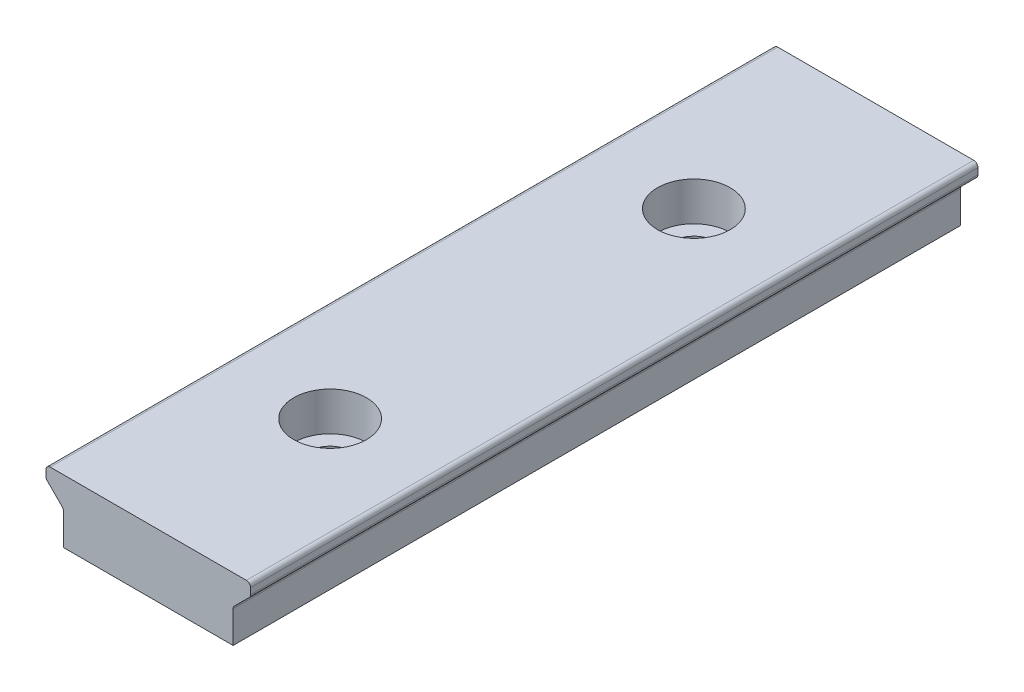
ISO-10303-21;
HEADER;
FILE_DESCRIPTION(('STEP AP214'),'2;1');
FILE_NAME('part.step','',(''),(''),'','','');
FILE_SCHEMA(('AUTOMOTIVE_DESIGN { 1 0 10303 214 1 1 1 1 }'));
ENDSEC;
DATA;
#1=APPLICATION_CONTEXT('core data for automotive mechanical design processes');
#2=APPLICATION_PROTOCOL_DEFINITION('international standard','automotive_design',2000,#1);
#3=PRODUCT_CONTEXT('',#1,'mechanical');
#4=PRODUCT('Part','Part','',(#3));
#5=PRODUCT_RELATED_PRODUCT_CATEGORY('part','',(#4));
#6=PRODUCT_DEFINITION_FORMATION('','',#4);
#7=PRODUCT_DEFINITION_CONTEXT('part definition',#1,'design');
#8=PRODUCT_DEFINITION('design','',#6,#7);
#9=PRODUCT_DEFINITION_SHAPE('','',#8);
#10=(LENGTH_UNIT() NAMED_UNIT(*) SI_UNIT(.MILLI.,.METRE.));
#11=(NAMED_UNIT(*) PLANE_ANGLE_UNIT() SI_UNIT($,.RADIAN.));
#12=(NAMED_UNIT(*) SI_UNIT($,.STERADIAN.) SOLID_ANGLE_UNIT());
#13=UNCERTAINTY_MEASURE_WITH_UNIT(LENGTH_MEASURE(1.E-05),#10,'distance_accuracy_value','');
#14=(GEOMETRIC_REPRESENTATION_CONTEXT(3) GLOBAL_UNCERTAINTY_ASSIGNED_CONTEXT((#13)) GLOBAL_UNIT_ASSIGNED_CONTEXT((#10,
#11,#12)) REPRESENTATION_CONTEXT('',''));
#15=CARTESIAN_POINT('',(0.,0.,0.));
#16=DIRECTION('',(0.,0.,1.));
#17=DIRECTION('',(1.,0.,0.));
#18=AXIS2_PLACEMENT_3D('',#15,#16,#17);
#19=CARTESIAN_POINT('',(0.,1.50487261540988E-13,60.0000000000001));
#20=DIRECTION('',(0.,1.,0.));
#21=DIRECTION('',(0.,0.,1.));
#22=AXIS2_PLACEMENT_3D('',#19,#20,#21);
#23=PLANE('',#22);
#24=CARTESIAN_POINT('',(0.,0.,45.0000000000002));
#25=DIRECTION('',(0.,1.,0.));
#26=DIRECTION('',(0.,0.,1.));
#27=AXIS2_PLACEMENT_3D('',#24,#25,#26);
#28=CIRCLE('',#27,1.75);
#29=CARTESIAN_POINT('',(0.,0.,46.7500000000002));
#30=VERTEX_POINT('',#29);
#31=EDGE_CURVE('E357',#30,#30,#28,.T.);
#32=ORIENTED_EDGE('',*,*,#31,.T.);
#33=EDGE_LOOP('',(#32));
#34=FACE_BOUND('',#33,.T.);
#35=CARTESIAN_POINT('',(0.,0.,15.0000000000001));
#36=DIRECTION('',(0.,1.,0.));
#37=DIRECTION('',(0.,0.,1.));
#38=AXIS2_PLACEMENT_3D('',#35,#36,#37);
#39=CIRCLE('',#38,1.75);
#40=CARTESIAN_POINT('',(0.,0.,16.7500000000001));
#41=VERTEX_POINT('',#40);
#42=EDGE_CURVE('E43',#41,#41,#39,.T.);
#43=ORIENTED_EDGE('',*,*,#42,.T.);
#44=EDGE_LOOP('',(#43));
#45=FACE_BOUND('',#44,.T.);
#46=DIRECTION('',(1.,0.,0.));
#47=VECTOR('',#46,1.);
#48=CARTESIAN_POINT('',(0.,0.,0.));
#49=LINE('',#48,#47);
#50=CARTESIAN_POINT('',(-6.99999999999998,0.,0.));
#51=VERTEX_POINT('',#50);
#52=CARTESIAN_POINT('',(6.99999999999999,0.,0.));
#53=VERTEX_POINT('',#52);
#54=EDGE_CURVE('E170',#51,#53,#49,.T.);
#55=ORIENTED_EDGE('',*,*,#54,.T.);
#56=DIRECTION('',(0.,0.,-1.));
#57=VECTOR('',#56,1.);
#58=CARTESIAN_POINT('',(7.00000000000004,1.21864324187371E-13,60.0000000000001));
#59=LINE('',#58,#57);
#60=CARTESIAN_POINT('',(7.00000000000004,1.21864324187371E-13,60.0000000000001));
#61=VERTEX_POINT('',#60);
#62=EDGE_CURVE('E244',#61,#53,#59,.T.);
#63=ORIENTED_EDGE('',*,*,#62,.F.);
#64=DIRECTION('',(1.,0.,0.));
#65=VECTOR('',#64,1.);
#66=CARTESIAN_POINT('',(0.,1.50487261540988E-13,60.0000000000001));
#67=LINE('',#66,#65);
#68=CARTESIAN_POINT('',(-6.9999999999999,1.46150452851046E-13,60.0000000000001));
#69=VERTEX_POINT('',#68);
#70=EDGE_CURVE('E185',#69,#61,#67,.T.);
#71=ORIENTED_EDGE('',*,*,#70,.F.);
#72=DIRECTION('',(0.,0.,-1.));
#73=VECTOR('',#72,1.);
#74=CARTESIAN_POINT('',(-6.9999999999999,1.46150452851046E-13,60.0000000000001));
#75=LINE('',#74,#73);
#76=EDGE_CURVE('E182',#69,#51,#75,.T.);
#77=ORIENTED_EDGE('',*,*,#76,.T.);
#78=EDGE_LOOP('',(#55,#63,#71,#77));
#79=FACE_BOUND('',#78,.T.);
#80=ADVANCED_FACE('F40',(#34,#45,#79),#23,.F.);
#81=CARTESIAN_POINT('',(7.00000000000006,2.7658328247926,60.0000000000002));
#82=DIRECTION('',(-1.,0.,0.));
#83=DIRECTION('',(0.,0.,1.));
#84=AXIS2_PLACEMENT_3D('',#81,#82,#83);
#85=PLANE('',#84);
#86=DIRECTION('',(0.,1.,0.));
#87=VECTOR('',#86,1.);
#88=CARTESIAN_POINT('',(7.,2.76583282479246,0.));
#89=LINE('',#88,#87);
#90=CARTESIAN_POINT('',(7.,2.6208580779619,0.));
#91=VERTEX_POINT('',#90);
#92=EDGE_CURVE('E177',#53,#91,#89,.T.);
#93=ORIENTED_EDGE('',*,*,#92,.T.);
#94=DIRECTION('',(0.,0.,-1.));
#95=VECTOR('',#94,1.);
#96=CARTESIAN_POINT('',(7.00000000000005,2.62085807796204,60.0000000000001));
#97=LINE('',#96,#95);
#98=CARTESIAN_POINT('',(7.00000000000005,2.62085807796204,60.0000000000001));
#99=VERTEX_POINT('',#98);
#100=EDGE_CURVE('E254',#91,#99,#97,.F.);
#101=ORIENTED_EDGE('',*,*,#100,.T.);
#102=DIRECTION('',(0.,1.,0.));
#103=VECTOR('',#102,1.);
#104=CARTESIAN_POINT('',(7.00000000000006,2.7658328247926,60.0000000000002));
#105=LINE('',#104,#103);
#106=EDGE_CURVE('E229',#61,#99,#105,.T.);
#107=ORIENTED_EDGE('',*,*,#106,.F.);
#108=ORIENTED_EDGE('',*,*,#62,.T.);
#109=EDGE_LOOP('',(#93,#101,#107,#108));
#110=FACE_BOUND('',#109,.T.);
#111=ADVANCED_FACE('F391',(#110),#85,.F.);
#112=CARTESIAN_POINT('',(8.43416717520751,4.20000000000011,60.0000000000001));
#113=DIRECTION('',(-0.707106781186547,0.707106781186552,0.));
#114=DIRECTION('',(-0.707106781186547,-0.707106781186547,0.));
#115=AXIS2_PLACEMENT_3D('',#112,#113,#114);
#116=PLANE('',#115);
#117=DIRECTION('',(0.707106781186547,0.707106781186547,0.));
#118=VECTOR('',#117,1.);
#119=CARTESIAN_POINT('',(8.43416717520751,4.20000000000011,60.0000000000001));
#120=LINE('',#119,#118);
#121=CARTESIAN_POINT('',(7.10251262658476,2.86834545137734,60.0000000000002));
#122=VERTEX_POINT('',#121);
#123=CARTESIAN_POINT('',(8.33165454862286,4.09748737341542,60.0000000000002));
#124=VERTEX_POINT('',#123);
#125=EDGE_CURVE('E233',#122,#124,#120,.T.);
#126=ORIENTED_EDGE('',*,*,#125,.F.);
#127=DIRECTION('',(0.,0.,-1.));
#128=VECTOR('',#127,1.);
#129=CARTESIAN_POINT('',(7.1025126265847,2.86834545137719,0.));
#130=LINE('',#129,#128);
#131=CARTESIAN_POINT('',(7.10251262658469,2.86834545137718,0.));
#132=VERTEX_POINT('',#131);
#133=EDGE_CURVE('E250',#122,#132,#130,.T.);
#134=ORIENTED_EDGE('',*,*,#133,.T.);
#135=DIRECTION('',(0.707106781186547,0.707106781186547,0.));
#136=VECTOR('',#135,1.);
#137=CARTESIAN_POINT('',(8.4341671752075,4.19999999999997,0.));
#138=LINE('',#137,#136);
#139=CARTESIAN_POINT('',(8.33165454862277,4.0974873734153,0.));
#140=VERTEX_POINT('',#139);
#141=EDGE_CURVE('E216',#132,#140,#138,.T.);
#142=ORIENTED_EDGE('',*,*,#141,.T.);
#143=DIRECTION('',(0.,0.,-1.));
#144=VECTOR('',#143,1.);
#145=CARTESIAN_POINT('',(8.33165454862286,4.09748737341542,60.0000000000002));
#146=LINE('',#145,#144);
#147=EDGE_CURVE('E247',#140,#124,#146,.F.);
#148=ORIENTED_EDGE('',*,*,#147,.T.);
#149=EDGE_LOOP('',(#126,#134,#142,#148));
#150=FACE_BOUND('',#149,.T.);
#151=ADVANCED_FACE('F396',(#150),#116,.F.);
#152=CARTESIAN_POINT('',(8.43416717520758,5.2000000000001,60.0000000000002));
#153=DIRECTION('',(-1.,0.,0.));
#154=DIRECTION('',(0.,0.,1.));
#155=AXIS2_PLACEMENT_3D('',#152,#153,#154);
#156=PLANE('',#155);
#157=DIRECTION('',(0.,1.,0.));
#158=VECTOR('',#157,1.);
#159=CARTESIAN_POINT('',(8.43416717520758,5.2000000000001,60.0000000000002));
#160=LINE('',#159,#158);
#161=CARTESIAN_POINT('',(8.43416717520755,4.34497474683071,60.0000000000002));
#162=VERTEX_POINT('',#161);
#163=CARTESIAN_POINT('',(8.43416717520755,4.85000000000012,60.0000000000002));
#164=VERTEX_POINT('',#163);
#165=EDGE_CURVE('E237',#162,#164,#160,.T.);
#166=ORIENTED_EDGE('',*,*,#165,.F.);
#167=DIRECTION('',(0.,0.,-1.));
#168=VECTOR('',#167,1.);
#169=CARTESIAN_POINT('',(8.43416717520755,4.34497474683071,60.0000000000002));
#170=LINE('',#169,#168);
#171=CARTESIAN_POINT('',(8.43416717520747,4.34497474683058,0.));
#172=VERTEX_POINT('',#171);
#173=EDGE_CURVE('E260',#162,#172,#170,.T.);
#174=ORIENTED_EDGE('',*,*,#173,.T.);
#175=DIRECTION('',(0.,1.,0.));
#176=VECTOR('',#175,1.);
#177=CARTESIAN_POINT('',(8.4341671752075,5.2,0.));
#178=LINE('',#177,#176);
#179=CARTESIAN_POINT('',(8.43416717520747,4.84999999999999,0.));
#180=VERTEX_POINT('',#179);
#181=EDGE_CURVE('E220',#172,#180,#178,.T.);
#182=ORIENTED_EDGE('',*,*,#181,.T.);
#183=DIRECTION('',(0.,0.,-1.));
#184=VECTOR('',#183,1.);
#185=CARTESIAN_POINT('',(8.43416717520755,4.85000000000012,60.0000000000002));
#186=LINE('',#185,#184);
#187=EDGE_CURVE('E257',#180,#164,#186,.F.);
#188=ORIENTED_EDGE('',*,*,#187,.T.);
#189=EDGE_LOOP('',(#166,#174,#182,#188));
#190=FACE_BOUND('',#189,.T.);
#191=ADVANCED_FACE('F371',(#190),#156,.F.);
#192=CARTESIAN_POINT('',(0.,5.20000000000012,60.0000000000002));
#193=DIRECTION('',(0.,-1.,0.));
#194=DIRECTION('',(0.,0.,-1.));
#195=AXIS2_PLACEMENT_3D('',#192,#193,#194);
#196=PLANE('',#195);
#197=CARTESIAN_POINT('',(0.,5.20000000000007,45.0000000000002));
#198=DIRECTION('',(0.,1.,0.));
#199=DIRECTION('',(0.,0.,1.));
#200=AXIS2_PLACEMENT_3D('',#197,#198,#199);
#201=CIRCLE('',#200,3.);
#202=CARTESIAN_POINT('',(0.,5.20000000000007,48.0000000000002));
#203=VERTEX_POINT('',#202);
#204=EDGE_CURVE('E361',#203,#203,#201,.T.);
#205=ORIENTED_EDGE('',*,*,#204,.F.);
#206=EDGE_LOOP('',(#205));
#207=FACE_BOUND('',#206,.T.);
#208=CARTESIAN_POINT('',(0.,5.20000000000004,15.));
#209=DIRECTION('',(0.,1.,0.));
#210=DIRECTION('',(0.,0.,1.));
#211=AXIS2_PLACEMENT_3D('',#208,#209,#210);
#212=CIRCLE('',#211,3.);
#213=CARTESIAN_POINT('',(0.,5.20000000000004,18.));
#214=VERTEX_POINT('',#213);
#215=EDGE_CURVE('E337',#214,#214,#212,.T.);
#216=ORIENTED_EDGE('',*,*,#215,.F.);
#217=EDGE_LOOP('',(#216));
#218=FACE_BOUND('',#217,.T.);
#219=DIRECTION('',(-1.,0.,0.));
#220=VECTOR('',#219,1.);
#221=CARTESIAN_POINT('',(0.,5.20000000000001,0.));
#222=LINE('',#221,#220);
#223=CARTESIAN_POINT('',(8.08416717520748,5.2,0.));
#224=VERTEX_POINT('',#223);
#225=CARTESIAN_POINT('',(-8.08416717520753,5.20000000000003,0.));
#226=VERTEX_POINT('',#225);
#227=EDGE_CURVE('E224',#224,#226,#222,.T.);
#228=ORIENTED_EDGE('',*,*,#227,.T.);
#229=DIRECTION('',(0.,0.,-1.));
#230=VECTOR('',#229,1.);
#231=CARTESIAN_POINT('',(-8.08416717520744,5.20000000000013,60.0000000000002));
#232=LINE('',#231,#230);
#233=CARTESIAN_POINT('',(-8.08416717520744,5.20000000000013,60.0000000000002));
#234=VERTEX_POINT('',#233);
#235=EDGE_CURVE('E58',#226,#234,#232,.F.);
#236=ORIENTED_EDGE('',*,*,#235,.T.);
#237=DIRECTION('',(-1.,0.,0.));
#238=VECTOR('',#237,1.);
#239=CARTESIAN_POINT('',(7.00000000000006,5.20000000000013,60.0000000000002));
#240=LINE('',#239,#238);
#241=CARTESIAN_POINT('',(8.08416717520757,5.20000000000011,60.0000000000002));
#242=VERTEX_POINT('',#241);
#243=EDGE_CURVE('E241',#242,#234,#240,.T.);
#244=ORIENTED_EDGE('',*,*,#243,.F.);
#245=DIRECTION('',(0.,0.,-1.));
#246=VECTOR('',#245,1.);
#247=CARTESIAN_POINT('',(8.08416717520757,5.20000000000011,60.0000000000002));
#248=LINE('',#247,#246);
#249=EDGE_CURVE('E275',#242,#224,#248,.T.);
#250=ORIENTED_EDGE('',*,*,#249,.T.);
#251=EDGE_LOOP('',(#228,#236,#244,#250));
#252=FACE_BOUND('',#251,.T.);
#253=ADVANCED_FACE('F368',(#207,#218,#252),#196,.F.);
#254=CARTESIAN_POINT('',(0.,1.50487261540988E-13,60.0000000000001));
#255=DIRECTION('',(0.,0.,1.));
#256=DIRECTION('',(1.,0.,0.));
#257=AXIS2_PLACEMENT_3D('',#254,#255,#256);
#258=PLANE('',#257);
#259=DIRECTION('',(0.,1.,0.));
#260=VECTOR('',#259,1.);
#261=CARTESIAN_POINT('',(-8.43416717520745,5.20000000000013,60.0000000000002));
#262=LINE('',#261,#260);
#263=CARTESIAN_POINT('',(-8.43416717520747,4.3449747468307,60.0000000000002));
#264=VERTEX_POINT('',#263);
#265=CARTESIAN_POINT('',(-8.43416717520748,4.85000000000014,60.0000000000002));
#266=VERTEX_POINT('',#265);
#267=EDGE_CURVE('E197',#264,#266,#262,.T.);
#268=ORIENTED_EDGE('',*,*,#267,.F.);
#269=CARTESIAN_POINT('',(-8.0841671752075,4.34497474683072,60.0000000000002));
#270=DIRECTION('',(0.,0.,1.));
#271=DIRECTION('',(1.,0.,0.));
#272=AXIS2_PLACEMENT_3D('',#269,#270,#271);
#273=CIRCLE('',#272,0.35);
#274=CARTESIAN_POINT('',(-8.33165454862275,4.09748737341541,60.0000000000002));
#275=VERTEX_POINT('',#274);
#276=EDGE_CURVE('E309',#264,#275,#273,.T.);
#277=ORIENTED_EDGE('',*,*,#276,.T.);
#278=DIRECTION('',(-0.70710678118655,0.70710678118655,0.));
#279=VECTOR('',#278,1.);
#280=CARTESIAN_POINT('',(-8.43416717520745,4.20000000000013,60.0000000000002));
#281=LINE('',#280,#279);
#282=CARTESIAN_POINT('',(-7.10251262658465,2.86834545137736,60.0000000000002));
#283=VERTEX_POINT('',#282);
#284=EDGE_CURVE('E202',#283,#275,#281,.T.);
#285=ORIENTED_EDGE('',*,*,#284,.F.);
#286=CARTESIAN_POINT('',(-7.3499999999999,2.62085807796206,60.0000000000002));
#287=DIRECTION('',(0.,0.,1.));
#288=DIRECTION('',(1.,0.,0.));
#289=AXIS2_PLACEMENT_3D('',#286,#287,#288);
#290=CIRCLE('',#289,0.35);
#291=CARTESIAN_POINT('',(-6.99999999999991,2.62085807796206,60.0000000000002));
#292=VERTEX_POINT('',#291);
#293=EDGE_CURVE('E11',#283,#292,#290,.F.);
#294=ORIENTED_EDGE('',*,*,#293,.T.);
#295=DIRECTION('',(0.,1.,0.));
#296=VECTOR('',#295,1.);
#297=CARTESIAN_POINT('',(-6.99999999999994,2.76583282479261,60.0000000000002));
#298=LINE('',#297,#296);
#299=EDGE_CURVE('E190',#69,#292,#298,.T.);
#300=ORIENTED_EDGE('',*,*,#299,.F.);
#301=ORIENTED_EDGE('',*,*,#70,.T.);
#302=ORIENTED_EDGE('',*,*,#106,.T.);
#303=CARTESIAN_POINT('',(7.3500000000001,2.62085807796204,60.0000000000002));
#304=DIRECTION('',(0.,0.,1.));
#305=DIRECTION('',(1.,0.,0.));
#306=AXIS2_PLACEMENT_3D('',#303,#304,#305);
#307=CIRCLE('',#306,0.35);
#308=EDGE_CURVE('E282',#99,#122,#307,.F.);
#309=ORIENTED_EDGE('',*,*,#308,.T.);
#310=ORIENTED_EDGE('',*,*,#125,.T.);
#311=CARTESIAN_POINT('',(8.08416717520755,4.34497474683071,60.0000000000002));
#312=DIRECTION('',(0.,0.,1.));
#313=DIRECTION('',(1.,0.,0.));
#314=AXIS2_PLACEMENT_3D('',#311,#312,#313);
#315=CIRCLE('',#314,0.35);
#316=EDGE_CURVE('E272',#124,#162,#315,.T.);
#317=ORIENTED_EDGE('',*,*,#316,.T.);
#318=ORIENTED_EDGE('',*,*,#165,.T.);
#319=CARTESIAN_POINT('',(8.08416717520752,4.85000000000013,60.0000000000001));
#320=DIRECTION('',(0.,0.,1.));
#321=DIRECTION('',(1.,0.,0.));
#322=AXIS2_PLACEMENT_3D('',#319,#320,#321);
#323=CIRCLE('',#322,0.35);
#324=EDGE_CURVE('E269',#164,#242,#323,.T.);
#325=ORIENTED_EDGE('',*,*,#324,.T.);
#326=ORIENTED_EDGE('',*,*,#243,.T.);
#327=CARTESIAN_POINT('',(-8.08416717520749,4.85000000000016,60.0000000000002));
#328=DIRECTION('',(0.,0.,1.));
#329=DIRECTION('',(1.,0.,0.));
#330=AXIS2_PLACEMENT_3D('',#327,#328,#329);
#331=CIRCLE('',#330,0.35);
#332=EDGE_CURVE('E66',#234,#266,#331,.T.);
#333=ORIENTED_EDGE('',*,*,#332,.T.);
#334=EDGE_LOOP('',(#268,#277,#285,#294,#300,#301,#302,#309,#310,#317,#318,#325,#326,#333));
#335=FACE_BOUND('',#334,.T.);
#336=ADVANCED_FACE('F324',(#335),#258,.T.);
#337=CARTESIAN_POINT('',(0.,0.,0.));
#338=DIRECTION('',(0.,0.,1.));
#339=DIRECTION('',(1.,0.,0.));
#340=AXIS2_PLACEMENT_3D('',#337,#338,#339);
#341=PLANE('',#340);
#342=DIRECTION('',(-0.70710678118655,0.70710678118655,0.));
#343=VECTOR('',#342,1.);
#344=CARTESIAN_POINT('',(-8.43416717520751,4.20000000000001,0.));
#345=LINE('',#344,#343);
#346=CARTESIAN_POINT('',(-7.10251262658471,2.86834545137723,0.));
#347=VERTEX_POINT('',#346);
#348=CARTESIAN_POINT('',(-8.33165454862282,4.09748737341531,0.));
#349=VERTEX_POINT('',#348);
#350=EDGE_CURVE('E198',#347,#349,#345,.T.);
#351=ORIENTED_EDGE('',*,*,#350,.T.);
#352=CARTESIAN_POINT('',(-8.08416717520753,4.34497474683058,0.));
#353=DIRECTION('',(0.,0.,1.));
#354=DIRECTION('',(1.,0.,0.));
#355=AXIS2_PLACEMENT_3D('',#352,#353,#354);
#356=CIRCLE('',#355,0.35);
#357=CARTESIAN_POINT('',(-8.43416717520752,4.34497474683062,0.));
#358=VERTEX_POINT('',#357);
#359=EDGE_CURVE('E297',#349,#358,#356,.F.);
#360=ORIENTED_EDGE('',*,*,#359,.T.);
#361=DIRECTION('',(0.,1.,0.));
#362=VECTOR('',#361,1.);
#363=CARTESIAN_POINT('',(-8.43416717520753,5.20000000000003,0.));
#364=LINE('',#363,#362);
#365=CARTESIAN_POINT('',(-8.43416717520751,4.85000000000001,0.));
#366=VERTEX_POINT('',#365);
#367=EDGE_CURVE('E205',#358,#366,#364,.T.);
#368=ORIENTED_EDGE('',*,*,#367,.T.);
#369=CARTESIAN_POINT('',(-8.08416717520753,4.85000000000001,0.));
#370=DIRECTION('',(0.,0.,1.));
#371=DIRECTION('',(1.,0.,0.));
#372=AXIS2_PLACEMENT_3D('',#369,#370,#371);
#373=CIRCLE('',#372,0.35);
#374=EDGE_CURVE('E294',#366,#226,#373,.F.);
#375=ORIENTED_EDGE('',*,*,#374,.T.);
#376=ORIENTED_EDGE('',*,*,#227,.F.);
#377=CARTESIAN_POINT('',(8.08416717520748,4.84999999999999,0.));
#378=DIRECTION('',(0.,0.,1.));
#379=DIRECTION('',(1.,0.,0.));
#380=AXIS2_PLACEMENT_3D('',#377,#378,#379);
#381=CIRCLE('',#380,0.35);
#382=EDGE_CURVE('E264',#224,#180,#381,.F.);
#383=ORIENTED_EDGE('',*,*,#382,.T.);
#384=ORIENTED_EDGE('',*,*,#181,.F.);
#385=CARTESIAN_POINT('',(8.08416717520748,4.34497474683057,0.));
#386=DIRECTION('',(0.,0.,1.));
#387=DIRECTION('',(1.,0.,0.));
#388=AXIS2_PLACEMENT_3D('',#385,#386,#387);
#389=CIRCLE('',#388,0.35);
#390=EDGE_CURVE('E266',#172,#140,#389,.F.);
#391=ORIENTED_EDGE('',*,*,#390,.T.);
#392=ORIENTED_EDGE('',*,*,#141,.F.);
#393=CARTESIAN_POINT('',(7.34999999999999,2.6208580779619,0.));
#394=DIRECTION('',(0.,0.,1.));
#395=DIRECTION('',(1.,0.,0.));
#396=AXIS2_PLACEMENT_3D('',#393,#394,#395);
#397=CIRCLE('',#396,0.35);
#398=EDGE_CURVE('E279',#132,#91,#397,.T.);
#399=ORIENTED_EDGE('',*,*,#398,.T.);
#400=ORIENTED_EDGE('',*,*,#92,.F.);
#401=ORIENTED_EDGE('',*,*,#54,.F.);
#402=DIRECTION('',(0.,1.,0.));
#403=VECTOR('',#402,1.);
#404=CARTESIAN_POINT('',(-7.,2.76583282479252,0.));
#405=LINE('',#404,#403);
#406=CARTESIAN_POINT('',(-7.,2.62085807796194,0.));
#407=VERTEX_POINT('',#406);
#408=EDGE_CURVE('E175',#51,#407,#405,.T.);
#409=ORIENTED_EDGE('',*,*,#408,.T.);
#410=CARTESIAN_POINT('',(-7.34999999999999,2.62085807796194,0.));
#411=DIRECTION('',(0.,0.,1.));
#412=DIRECTION('',(1.,0.,0.));
#413=AXIS2_PLACEMENT_3D('',#410,#411,#412);
#414=CIRCLE('',#413,0.35);
#415=EDGE_CURVE('E49',#407,#347,#414,.T.);
#416=ORIENTED_EDGE('',*,*,#415,.T.);
#417=EDGE_LOOP('',(#351,#360,#368,#375,#376,#383,#384,#391,#392,#399,#400,#401,#409,#416));
#418=FACE_BOUND('',#417,.T.);
#419=ADVANCED_FACE('F173',(#418),#341,.F.);
#420=CARTESIAN_POINT('',(7.3500000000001,2.62085807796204,60.0000000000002));
#421=DIRECTION('',(0.,0.,1.));
#422=DIRECTION('',(1.,0.,0.));
#423=AXIS2_PLACEMENT_3D('',#420,#421,#422);
#424=CYLINDRICAL_SURFACE('',#423,0.35);
#425=ORIENTED_EDGE('',*,*,#308,.F.);
#426=ORIENTED_EDGE('',*,*,#100,.F.);
#427=ORIENTED_EDGE('',*,*,#398,.F.);
#428=ORIENTED_EDGE('',*,*,#133,.F.);
#429=EDGE_LOOP('',(#425,#426,#427,#428));
#430=FACE_BOUND('',#429,.T.);
#431=ADVANCED_FACE('F511',(#430),#424,.F.);
#432=CARTESIAN_POINT('',(8.08416717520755,4.34497474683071,60.0000000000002));
#433=DIRECTION('',(0.,0.,-1.));
#434=DIRECTION('',(-1.,0.,0.));
#435=AXIS2_PLACEMENT_3D('',#432,#433,#434);
#436=CYLINDRICAL_SURFACE('',#435,0.35);
#437=ORIENTED_EDGE('',*,*,#316,.F.);
#438=ORIENTED_EDGE('',*,*,#147,.F.);
#439=ORIENTED_EDGE('',*,*,#390,.F.);
#440=ORIENTED_EDGE('',*,*,#173,.F.);
#441=EDGE_LOOP('',(#437,#438,#439,#440));
#442=FACE_BOUND('',#441,.T.);
#443=ADVANCED_FACE('F577',(#442),#436,.T.);
#444=CARTESIAN_POINT('',(8.08416717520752,4.85000000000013,60.0000000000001));
#445=DIRECTION('',(0.,0.,-1.));
#446=DIRECTION('',(-1.,0.,0.));
#447=AXIS2_PLACEMENT_3D('',#444,#445,#446);
#448=CYLINDRICAL_SURFACE('',#447,0.35);
#449=ORIENTED_EDGE('',*,*,#324,.F.);
#450=ORIENTED_EDGE('',*,*,#187,.F.);
#451=ORIENTED_EDGE('',*,*,#382,.F.);
#452=ORIENTED_EDGE('',*,*,#249,.F.);
#453=EDGE_LOOP('',(#449,#450,#451,#452));
#454=FACE_BOUND('',#453,.T.);
#455=ADVANCED_FACE('F500',(#454),#448,.T.);
#456=CARTESIAN_POINT('',(-8.43416717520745,5.20000000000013,60.0000000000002));
#457=DIRECTION('',(-1.,0.,0.));
#458=DIRECTION('',(0.,0.,1.));
#459=AXIS2_PLACEMENT_3D('',#456,#457,#458);
#460=PLANE('',#459);
#461=ORIENTED_EDGE('',*,*,#367,.F.);
#462=DIRECTION('',(0.,0.,-1.));
#463=VECTOR('',#462,1.);
#464=CARTESIAN_POINT('',(-8.43416717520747,4.3449747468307,60.0000000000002));
#465=LINE('',#464,#463);
#466=EDGE_CURVE('E304',#358,#264,#465,.F.);
#467=ORIENTED_EDGE('',*,*,#466,.T.);
#468=ORIENTED_EDGE('',*,*,#267,.T.);
#469=DIRECTION('',(0.,0.,-1.));
#470=VECTOR('',#469,1.);
#471=CARTESIAN_POINT('',(-8.43416717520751,4.85000000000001,0.));
#472=LINE('',#471,#470);
#473=EDGE_CURVE('E300',#266,#366,#472,.T.);
#474=ORIENTED_EDGE('',*,*,#473,.T.);
#475=EDGE_LOOP('',(#461,#467,#468,#474));
#476=FACE_BOUND('',#475,.T.);
#477=ADVANCED_FACE('F332',(#476),#460,.T.);
#478=CARTESIAN_POINT('',(-8.43416717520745,4.20000000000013,60.0000000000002));
#479=DIRECTION('',(-0.707106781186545,-0.707106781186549,0.));
#480=DIRECTION('',(0.70710678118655,-0.70710678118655,0.));
#481=AXIS2_PLACEMENT_3D('',#478,#479,#480);
#482=PLANE('',#481);
#483=ORIENTED_EDGE('',*,*,#350,.F.);
#484=DIRECTION('',(0.,0.,-1.));
#485=VECTOR('',#484,1.);
#486=CARTESIAN_POINT('',(-7.10251262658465,2.86834545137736,60.0000000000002));
#487=LINE('',#486,#485);
#488=EDGE_CURVE('E291',#347,#283,#487,.F.);
#489=ORIENTED_EDGE('',*,*,#488,.T.);
#490=ORIENTED_EDGE('',*,*,#284,.T.);
#491=DIRECTION('',(0.,0.,-1.));
#492=VECTOR('',#491,1.);
#493=CARTESIAN_POINT('',(-8.33165454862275,4.09748737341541,60.0000000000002));
#494=LINE('',#493,#492);
#495=EDGE_CURVE('E287',#275,#349,#494,.T.);
#496=ORIENTED_EDGE('',*,*,#495,.T.);
#497=EDGE_LOOP('',(#483,#489,#490,#496));
#498=FACE_BOUND('',#497,.T.);
#499=ADVANCED_FACE('F319',(#498),#482,.T.);
#500=CARTESIAN_POINT('',(-6.99999999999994,2.76583282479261,60.0000000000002));
#501=DIRECTION('',(-1.,0.,0.));
#502=DIRECTION('',(0.,0.,1.));
#503=AXIS2_PLACEMENT_3D('',#500,#501,#502);
#504=PLANE('',#503);
#505=ORIENTED_EDGE('',*,*,#299,.T.);
#506=DIRECTION('',(0.,0.,-1.));
#507=VECTOR('',#506,1.);
#508=CARTESIAN_POINT('',(-7.,2.62085807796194,0.));
#509=LINE('',#508,#507);
#510=EDGE_CURVE('E195',#292,#407,#509,.T.);
#511=ORIENTED_EDGE('',*,*,#510,.T.);
#512=ORIENTED_EDGE('',*,*,#408,.F.);
#513=ORIENTED_EDGE('',*,*,#76,.F.);
#514=EDGE_LOOP('',(#505,#511,#512,#513));
#515=FACE_BOUND('',#514,.T.);
#516=ADVANCED_FACE('F193',(#515),#504,.T.);
#517=CARTESIAN_POINT('',(-7.3499999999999,2.62085807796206,60.0000000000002));
#518=DIRECTION('',(0.,0.,1.));
#519=DIRECTION('',(1.,0.,0.));
#520=AXIS2_PLACEMENT_3D('',#517,#518,#519);
#521=CYLINDRICAL_SURFACE('',#520,0.35);
#522=ORIENTED_EDGE('',*,*,#293,.F.);
#523=ORIENTED_EDGE('',*,*,#488,.F.);
#524=ORIENTED_EDGE('',*,*,#415,.F.);
#525=ORIENTED_EDGE('',*,*,#510,.F.);
#526=EDGE_LOOP('',(#522,#523,#524,#525));
#527=FACE_BOUND('',#526,.T.);
#528=ADVANCED_FACE('F323',(#527),#521,.F.);
#529=CARTESIAN_POINT('',(-8.0841671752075,4.34497474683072,60.0000000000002));
#530=DIRECTION('',(0.,0.,-1.));
#531=DIRECTION('',(-1.,0.,0.));
#532=AXIS2_PLACEMENT_3D('',#529,#530,#531);
#533=CYLINDRICAL_SURFACE('',#532,0.35);
#534=ORIENTED_EDGE('',*,*,#276,.F.);
#535=ORIENTED_EDGE('',*,*,#466,.F.);
#536=ORIENTED_EDGE('',*,*,#359,.F.);
#537=ORIENTED_EDGE('',*,*,#495,.F.);
#538=EDGE_LOOP('',(#534,#535,#536,#537));
#539=FACE_BOUND('',#538,.T.);
#540=ADVANCED_FACE('F327',(#539),#533,.T.);
#541=CARTESIAN_POINT('',(-8.08416717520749,4.85000000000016,60.0000000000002));
#542=DIRECTION('',(0.,0.,1.));
#543=DIRECTION('',(1.,0.,0.));
#544=AXIS2_PLACEMENT_3D('',#541,#542,#543);
#545=CYLINDRICAL_SURFACE('',#544,0.35);
#546=ORIENTED_EDGE('',*,*,#332,.F.);
#547=ORIENTED_EDGE('',*,*,#235,.F.);
#548=ORIENTED_EDGE('',*,*,#374,.F.);
#549=ORIENTED_EDGE('',*,*,#473,.F.);
#550=EDGE_LOOP('',(#546,#547,#548,#549));
#551=FACE_BOUND('',#550,.T.);
#552=ADVANCED_FACE('F377',(#551),#545,.T.);
#553=CARTESIAN_POINT('',(0.,5.20000000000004,15.));
#554=DIRECTION('',(0.,1.,0.));
#555=DIRECTION('',(0.,0.,1.));
#556=AXIS2_PLACEMENT_3D('',#553,#554,#555);
#557=CYLINDRICAL_SURFACE('',#556,1.75);
#558=CARTESIAN_POINT('',(0.,2.00000000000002,15.));
#559=DIRECTION('',(0.,1.,0.));
#560=DIRECTION('',(0.,0.,1.));
#561=AXIS2_PLACEMENT_3D('',#558,#559,#560);
#562=CIRCLE('',#561,1.75);
#563=CARTESIAN_POINT('',(0.,2.00000000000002,16.75));
#564=VERTEX_POINT('',#563);
#565=EDGE_CURVE('E346',#564,#564,#562,.T.);
#566=ORIENTED_EDGE('',*,*,#565,.T.);
#567=EDGE_LOOP('',(#566));
#568=FACE_BOUND('',#567,.T.);
#569=ORIENTED_EDGE('',*,*,#42,.F.);
#570=EDGE_LOOP('',(#569));
#571=FACE_BOUND('',#570,.T.);
#572=ADVANCED_FACE('F379',(#568,#571),#557,.F.);
#573=CARTESIAN_POINT('',(0.,5.20000000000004,15.));
#574=DIRECTION('',(0.,1.,0.));
#575=DIRECTION('',(0.,0.,1.));
#576=AXIS2_PLACEMENT_3D('',#573,#574,#575);
#577=CYLINDRICAL_SURFACE('',#576,3.);
#578=CARTESIAN_POINT('',(0.,2.00000000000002,15.));
#579=DIRECTION('',(0.,1.,0.));
#580=DIRECTION('',(0.,0.,1.));
#581=AXIS2_PLACEMENT_3D('',#578,#579,#580);
#582=CIRCLE('',#581,3.);
#583=CARTESIAN_POINT('',(0.,2.00000000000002,18.));
#584=VERTEX_POINT('',#583);
#585=EDGE_CURVE('E342',#584,#584,#582,.T.);
#586=ORIENTED_EDGE('',*,*,#585,.F.);
#587=EDGE_LOOP('',(#586));
#588=FACE_BOUND('',#587,.T.);
#589=ORIENTED_EDGE('',*,*,#215,.T.);
#590=EDGE_LOOP('',(#589));
#591=FACE_BOUND('',#590,.T.);
#592=ADVANCED_FACE('F385',(#588,#591),#577,.F.);
#593=CARTESIAN_POINT('',(1.75000000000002,2.00000000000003,15.));
#594=DIRECTION('',(0.,-1.,0.));
#595=DIRECTION('',(0.,0.,-1.));
#596=AXIS2_PLACEMENT_3D('',#593,#594,#595);
#597=PLANE('',#596);
#598=ORIENTED_EDGE('',*,*,#565,.F.);
#599=EDGE_LOOP('',(#598));
#600=FACE_BOUND('',#599,.T.);
#601=ORIENTED_EDGE('',*,*,#585,.T.);
#602=EDGE_LOOP('',(#601));
#603=FACE_BOUND('',#602,.T.);
#604=ADVANCED_FACE('F405',(#600,#603),#597,.F.);
#605=CARTESIAN_POINT('',(0.,5.20000000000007,45.0000000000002));
#606=DIRECTION('',(0.,1.,0.));
#607=DIRECTION('',(0.,0.,1.));
#608=AXIS2_PLACEMENT_3D('',#605,#606,#607);
#609=CYLINDRICAL_SURFACE('',#608,1.75);
#610=CARTESIAN_POINT('',(0.,2.00000000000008,45.0000000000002));
#611=DIRECTION('',(0.,1.,0.));
#612=DIRECTION('',(0.,0.,1.));
#613=AXIS2_PLACEMENT_3D('',#610,#611,#612);
#614=CIRCLE('',#613,1.75);
#615=CARTESIAN_POINT('',(0.,2.00000000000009,46.7500000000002));
#616=VERTEX_POINT('',#615);
#617=EDGE_CURVE('E353',#616,#616,#614,.T.);
#618=ORIENTED_EDGE('',*,*,#617,.T.);
#619=EDGE_LOOP('',(#618));
#620=FACE_BOUND('',#619,.T.);
#621=ORIENTED_EDGE('',*,*,#31,.F.);
#622=EDGE_LOOP('',(#621));
#623=FACE_BOUND('',#622,.T.);
#624=ADVANCED_FACE('F403',(#620,#623),#609,.F.);
#625=CARTESIAN_POINT('',(0.,5.20000000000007,45.0000000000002));
#626=DIRECTION('',(0.,1.,0.));
#627=DIRECTION('',(0.,0.,1.));
#628=AXIS2_PLACEMENT_3D('',#625,#626,#627);
#629=CYLINDRICAL_SURFACE('',#628,3.);
#630=CARTESIAN_POINT('',(0.,2.00000000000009,45.0000000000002));
#631=DIRECTION('',(0.,1.,0.));
#632=DIRECTION('',(0.,0.,1.));
#633=AXIS2_PLACEMENT_3D('',#630,#631,#632);
#634=CIRCLE('',#633,3.);
#635=CARTESIAN_POINT('',(0.,2.00000000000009,48.0000000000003));
#636=VERTEX_POINT('',#635);
#637=EDGE_CURVE('E349',#636,#636,#634,.T.);
#638=ORIENTED_EDGE('',*,*,#637,.F.);
#639=EDGE_LOOP('',(#638));
#640=FACE_BOUND('',#639,.T.);
#641=ORIENTED_EDGE('',*,*,#204,.T.);
#642=EDGE_LOOP('',(#641));
#643=FACE_BOUND('',#642,.T.);
#644=ADVANCED_FACE('F366',(#640,#643),#629,.F.);
#645=CARTESIAN_POINT('',(1.75000000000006,2.00000000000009,45.0000000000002));
#646=DIRECTION('',(0.,-1.,0.));
#647=DIRECTION('',(0.,0.,-1.));
#648=AXIS2_PLACEMENT_3D('',#645,#646,#647);
#649=PLANE('',#648);
#650=ORIENTED_EDGE('',*,*,#617,.F.);
#651=EDGE_LOOP('',(#650));
#652=FACE_BOUND('',#651,.T.);
#653=ORIENTED_EDGE('',*,*,#637,.T.);
#654=EDGE_LOOP('',(#653));
#655=FACE_BOUND('',#654,.T.);
#656=ADVANCED_FACE('F412',(#652,#655),#649,.F.);
#657=CLOSED_SHELL('',(#80,#111,#151,#191,#253,#336,#419,#431,#443,#455,#477,#499,#516,#528,#540,
#552,#572,#592,#604,#624,#644,#656));
#658=MANIFOLD_SOLID_BREP('B2',#657);
#659=ADVANCED_BREP_SHAPE_REPRESENTATION('',(#18,#658),#14);
#660=SHAPE_DEFINITION_REPRESENTATION(#9,#659);
ENDSEC;
END-ISO-10303-21;
